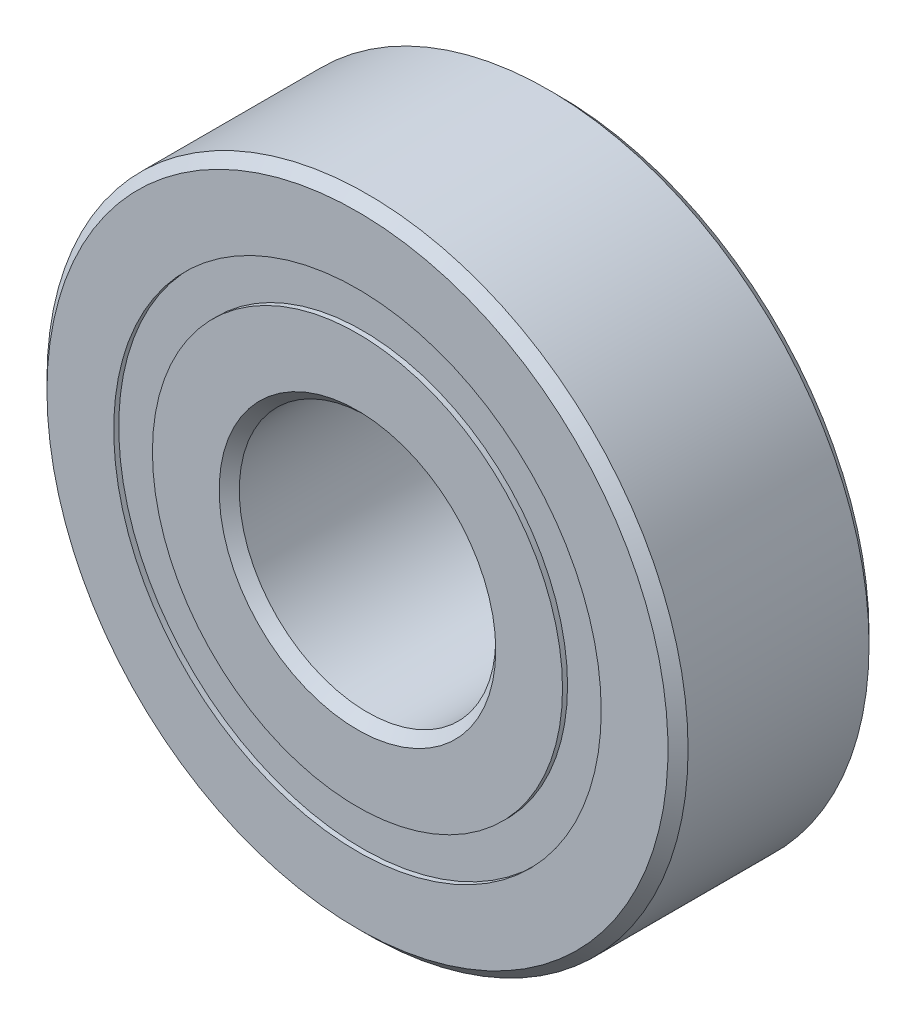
from build123d import *

# Parameters (mm, degrees)
CIRPATTERN1_COUNT = 8
SKETCH5_W         = 1.15919535
SKETCH5_H         = 0.957942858


with BuildPart() as part:
    # Sketch1 → Revolve1 (revolve)
    with BuildSketch(Plane(origin=(0, 0, 0), x_dir=(0, 0, -1), z_dir=(1, 0, 0)), mode=Mode.PRIVATE) as revolve1_sk:
        with BuildLine():
            Line((2.24028, 7.9375), (-2.24028, 7.9375))
            Line((-2.24028, 7.9375), (-2.4892, 7.68858))
            Line((-2.4892, 7.68858), (-2.4892, 6.035221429))
            Line((-2.4892, 6.035221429), (-1.106311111, 6.035221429))
            ThreePointArc((-1.106311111, 6.035221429), (0, 6.76179465), (1.106311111, 6.035221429))
            Line((1.106311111, 6.035221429), (2.4892, 6.035221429))
            Line((2.4892, 6.035221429), (2.4892, 7.68858))
            Line((2.4892, 7.68858), (2.24028, 7.9375))
        make_face()
    revolve(revolve1_sk.sketch.rotate(Axis((0, 0, 2.4892), (0, 0, -1)), 90), axis=Axis((0, 0, 2.4892), (0, 0, -1)))


with BuildPart() as body_2:
    # Sketch3 → Revolve3 (revolve)
    with BuildSketch(Plane(origin=(0, 0, 0), x_dir=(0, 0, -1), z_dir=(1, 0, 0)), mode=Mode.PRIVATE) as revolve3_sk:
        with BuildLine():
            Line((-2.4892, 5.077278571), (-1.106311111, 5.077278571))
            ThreePointArc((-1.106311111, 5.077278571), (0, 4.35070535), (1.106311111, 5.077278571))
            Line((1.106311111, 5.077278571), (2.4892, 5.077278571))
            Line((2.4892, 5.077278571), (2.4892, 3.42392))
            Line((2.4892, 3.42392), (2.24028, 3.175))
            Line((2.24028, 3.175), (-2.24028, 3.175))
            Line((-2.24028, 3.175), (-2.4892, 3.42392))
            Line((-2.4892, 3.42392), (-2.4892, 5.077278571))
        make_face()
    revolve(revolve3_sk.sketch.rotate(Axis((0, 0, 2.4892), (0, 0, -1)), 90), axis=Axis((0, 0, 2.4892), (0, 0, -1)))


with BuildPart() as body_3:
    # Sketch4 → Revolve4 (revolve)
    with BuildSketch(Plane(origin=(0, 0, 0), x_dir=(0, 0, -1), z_dir=(1, 0, 0))):
        with BuildLine():
            Line((-1.20554465, 5.55625), (1.20554465, 5.55625))
            ThreePointArc((1.20554465, 5.55625), (0, 6.76179465), (-1.20554465, 5.55625))
        make_face()
    revolve(axis=Axis((0, 5.55625, 1.20554465), (0, 0, -1)))


with BuildPart() as cirpattern1_1:
    # CirPattern1: pattern copy
    add(body_3.part.rotate(Axis((0, 0, 0), (0, 0, 1)), 1 * 360 / CIRPATTERN1_COUNT))


with BuildPart() as cirpattern1_2:
    # CirPattern1: pattern copy
    add(body_3.part.rotate(Axis((0, 0, 0), (0, 0, 1)), 2 * 360 / CIRPATTERN1_COUNT))


with BuildPart() as cirpattern1_3:
    # CirPattern1: pattern copy
    add(body_3.part.rotate(Axis((0, 0, 0), (0, 0, 1)), 3 * 360 / CIRPATTERN1_COUNT))


with BuildPart() as cirpattern1_4:
    # CirPattern1: pattern copy
    add(body_3.part.rotate(Axis((0, 0, 0), (0, 0, 1)), 4 * 360 / CIRPATTERN1_COUNT))


with BuildPart() as cirpattern1_5:
    # CirPattern1: pattern copy
    add(body_3.part.rotate(Axis((0, 0, 0), (0, 0, 1)), 5 * 360 / CIRPATTERN1_COUNT))


with BuildPart() as cirpattern1_6:
    # CirPattern1: pattern copy
    add(body_3.part.rotate(Axis((0, 0, 0), (0, 0, 1)), 6 * 360 / CIRPATTERN1_COUNT))


with BuildPart() as cirpattern1_7:
    # CirPattern1: pattern copy
    add(body_3.part.rotate(Axis((0, 0, 0), (0, 0, 1)), 7 * 360 / CIRPATTERN1_COUNT))


with BuildPart() as body_11:
    # Sketch5 → Revolve5 (revolve)
    with BuildSketch(Plane(origin=(0, 0, 0), x_dir=(0, 0, -1), z_dir=(1, 0, 0)), mode=Mode.PRIVATE) as revolve5_sk:
        with Locations((-1.785142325, 5.55625)):
            Rectangle(SKETCH5_W, SKETCH5_H)
        with Locations((1.785142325, 5.55625)):
            Rectangle(SKETCH5_W, SKETCH5_H)
    revolve(revolve5_sk.sketch.rotate(Axis((0, 0, 2.4892), (0, 0, -1)), 90), axis=Axis((0, 0, 2.4892), (0, 0, -1)))


solid = Compound([part.part, body_2.part, body_3.part, cirpattern1_1.part, cirpattern1_2.part, cirpattern1_3.part, cirpattern1_4.part, cirpattern1_5.part, cirpattern1_6.part, cirpattern1_7.part, body_11.part])
